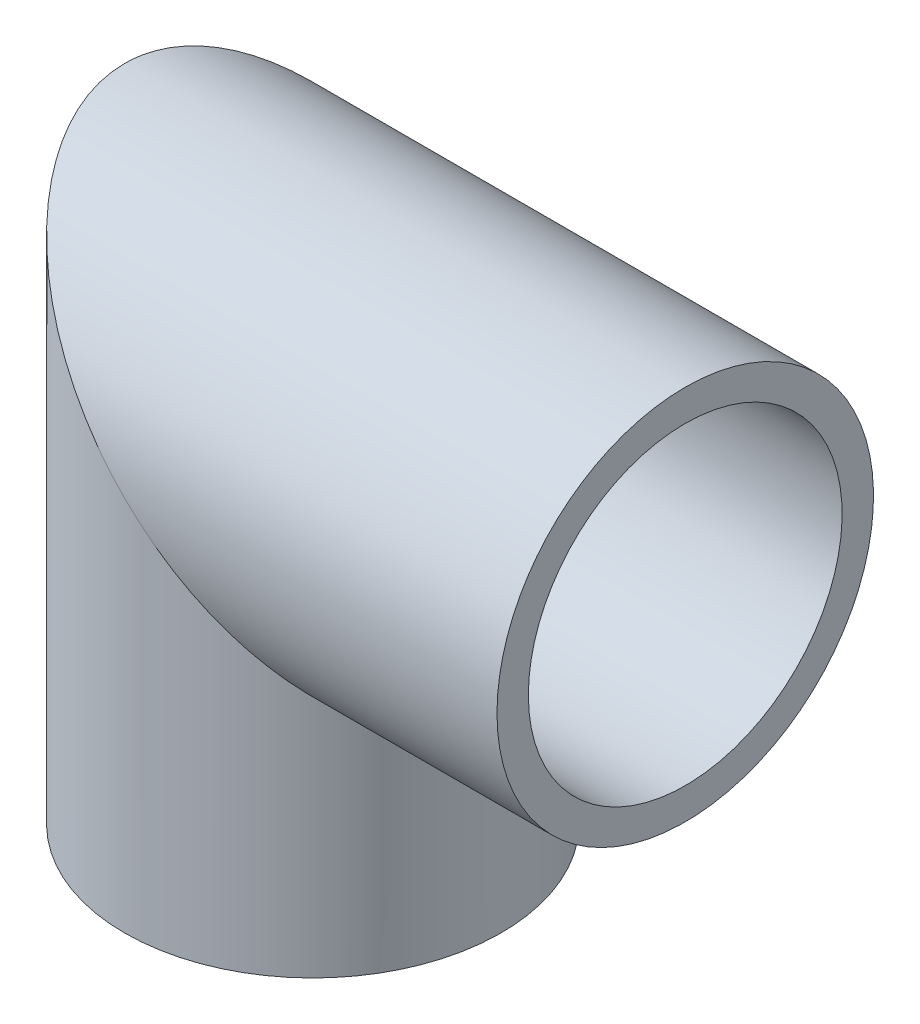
from build123d import *

# Parameters (mm, degrees)
CROQUIS1_R   = 6
CROQUIS1_R_2 = 5


with BuildPart() as part:
    # Barrer1: sweep along a path in Croquis2
    with BuildLine(Plane.XY) as barrer1_path:
        Line((0, 0), (0, 12))
        Line((0, 12), (11.87, 12))
    # Croquis1 → Barrer1 (sweep)
    with BuildSketch(Plane(origin=(0, 0, 0), x_dir=(1, 0, 0), z_dir=(0, 1, 0))):
        Circle(CROQUIS1_R)
        Circle(CROQUIS1_R_2, mode=Mode.SUBTRACT)
    sweep(path=barrer1_path.line, transition=Transition.RIGHT)


solid = part.part
